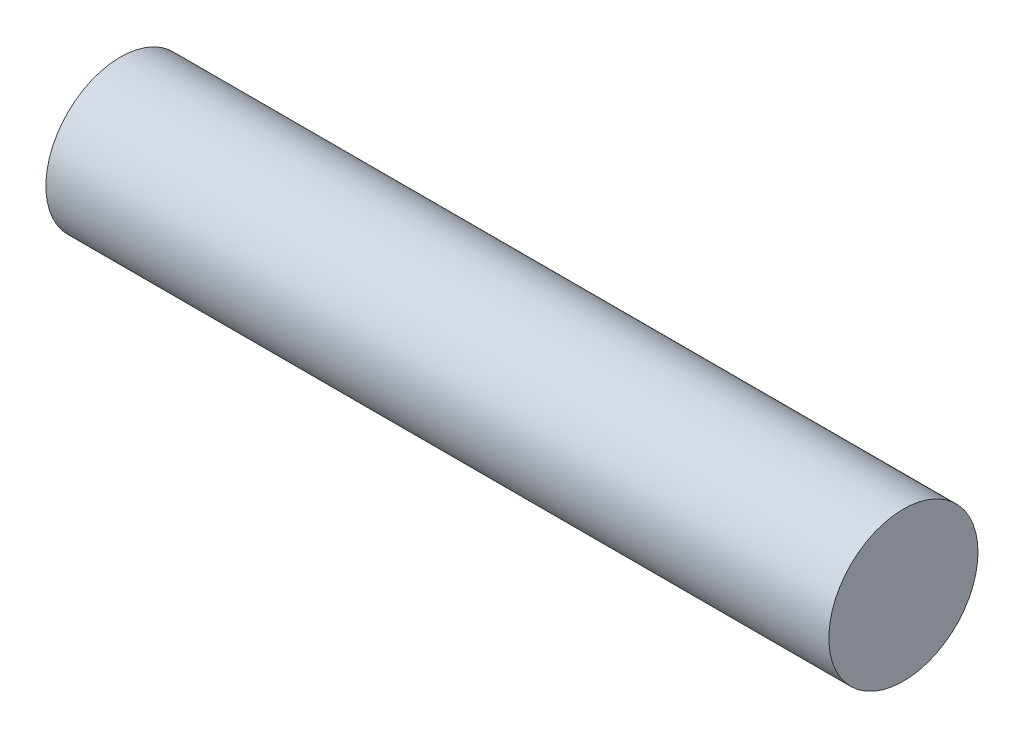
from build123d import *

# Parameters (mm, degrees)
SKETCH1_R           = 4.7625
BOSS_EXTRUDE1_DEPTH = 50


with BuildPart() as part:
    # Sketch1 → Boss-Extrude1 (new body)
    with BuildSketch(Plane(origin=(0, 0, 0), x_dir=(0, 0, -1), z_dir=(1, 0, 0))):
        Circle(SKETCH1_R)
    extrude(amount=BOSS_EXTRUDE1_DEPTH)


solid = part.part
